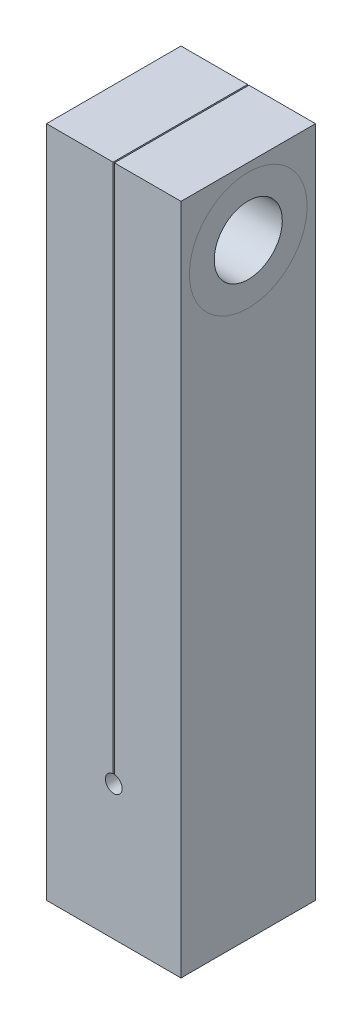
from build123d import *

# Parameters (mm, degrees)
BOSS_EXTRUDE1_DEPTH = 12.7
SKETCH2_R           = 6.4262
CUT_EXTRUDE1_DEPTH  = 106.494123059
SKETCH4_R           = 1.5875
CUT_EXTRUDE2_DEPTH  = 106.494123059


with BuildPart() as part:
    # Sketch1 → Boss-Extrude1 (new, symmetric)
    with BuildSketch(Plane.XY):
        Polygon((-0.127, 0), (0.127, 0), (0.127, 101.6), (12.7, 101.6), (12.7, -25.4), (-12.7, -25.4), (-12.7, 101.6), (-0.127, 101.6), align=None)
    extrude(amount=BOSS_EXTRUDE1_DEPTH, both=True)

    # Sketch2 → Cut-Extrude1 (cut, through all)
    with BuildSketch(Plane(origin=(12.7, 0, 0), x_dir=(0, 0, -1), z_dir=(1, 0, 0))):
        with Locations(Location((0, 88.9, 0), (0, 0, 90))):
            Circle(SKETCH2_R)
    extrude(amount=-CUT_EXTRUDE1_DEPTH, mode=Mode.SUBTRACT)

    # Sketch4 → Cut-Extrude2 (cut, through all)
    with BuildSketch(Plane.XY.offset(12.7)):
        Circle(SKETCH4_R)
    extrude(amount=-CUT_EXTRUDE2_DEPTH, mode=Mode.SUBTRACT)


solid = part.part
